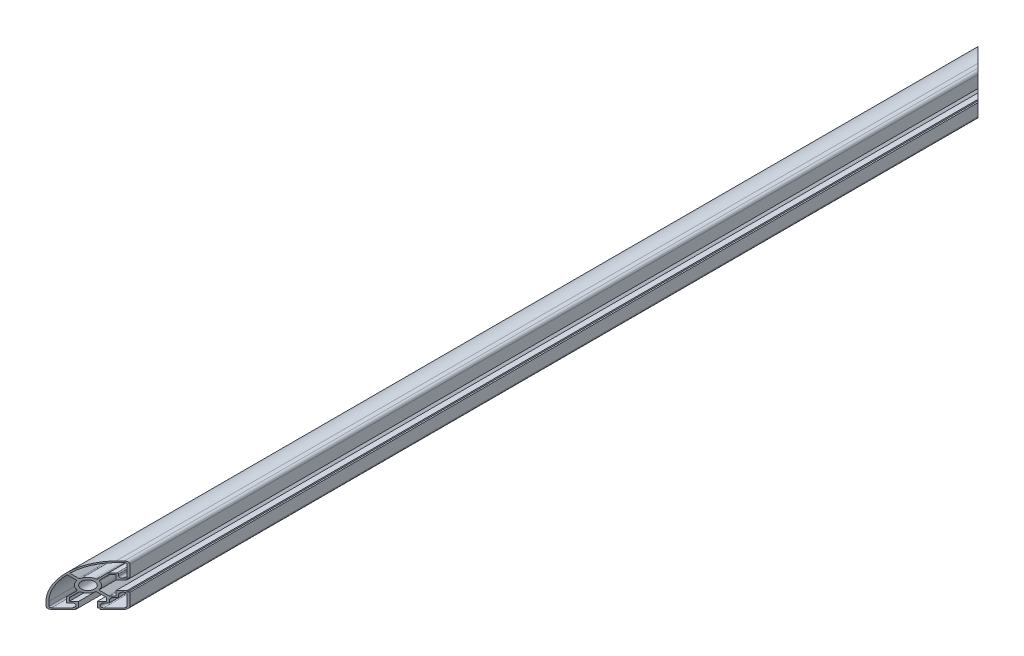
from build123d import *

# Parameters (mm, degrees)
LINEAR_START                    = 1560.85679
SKIZZE1_R                       = 5
LINEAR_AUSTRAGEN1_DEPTH         = 1000
SCHNITT_LINEAR_AUSTRAGEN2_DEPTH = 74.357312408


with BuildPart() as part:
    # Skizze1 → Linear austragen1 (new body)
    with BuildSketch(Plane.XY.offset(LINEAR_START)):
        with BuildLine():
            Line((-16, 0), (-3, 0))
            ThreePointArc((-3, 0), (-0.878679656, 0.878679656), (0, 3))
            Line((0, 3), (0, 16))
            Line((0, 16), (-1.5, 16))
            Line((-1.5, 16), (-1.5, 17.5))
            Line((-1.5, 17.5), (-7.5, 17.5))
            Line((-7.5, 17.5), (-7.5, 12.5))
            Line((-7.5, 12.5), (-10.671572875, 12.5))
            ThreePointArc((-10.671572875, 12.5), (-11.054256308, 12.576120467), (-11.378679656, 12.792893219))
            Line((-11.378679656, 12.792893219), (-16.667127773, 18.081341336))
            ThreePointArc((-16.667127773, 18.081341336), (-15.192648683, 22.113270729), (-16.233316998, 26.278310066))
            ThreePointArc((-16.233316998, 26.278310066), (-16.369567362, 26.915762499), (-16.084036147, 27.50175029))
            Line((-16.084036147, 27.50175029), (-11.378679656, 32.207106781))
            ThreePointArc((-11.378679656, 32.207106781), (-11.054256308, 32.423879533), (-10.671572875, 32.5))
            Line((-10.671572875, 32.5), (-7.5, 32.5))
            Line((-7.5, 32.5), (-7.5, 27.5))
            Line((-7.5, 27.5), (-1.5, 27.5))
            Line((-1.5, 27.5), (-1.5, 29))
            Line((-1.5, 29), (0, 29))
            Line((0, 29), (0, 42))
            ThreePointArc((0, 42), (-0.878679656, 44.121320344), (-3, 45))
            Line((-3, 45), (-7.5, 45))
            ThreePointArc((-7.5, 45), (-34.016504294, 34.016504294), (-45, 7.5))
            Line((-45, 7.5), (-45, 3))
            ThreePointArc((-45, 3), (-44.121320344, 0.878679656), (-42, 0))
            Line((-42, 0), (-29, 0))
            Line((-29, 0), (-29, 1.5))
            Line((-29, 1.5), (-27.5, 1.5))
            Line((-27.5, 1.5), (-27.5, 7.5))
            Line((-27.5, 7.5), (-32.5, 7.5))
            Line((-32.5, 7.5), (-32.5, 10.671572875))
            ThreePointArc((-32.5, 10.671572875), (-32.423879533, 11.054256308), (-32.207106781, 11.378679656))
            Line((-32.207106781, 11.378679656), (-27.50175029, 16.084036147))
            ThreePointArc((-27.50175029, 16.084036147), (-26.915762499, 16.369567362), (-26.278310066, 16.233316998))
            ThreePointArc((-26.278310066, 16.233316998), (-22.113270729, 15.192648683), (-18.081341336, 16.667127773))
            Line((-18.081341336, 16.667127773), (-12.792893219, 11.378679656))
            ThreePointArc((-12.792893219, 11.378679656), (-12.576120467, 11.054256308), (-12.5, 10.671572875))
            Line((-12.5, 10.671572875), (-12.5, 7.5))
            Line((-12.5, 7.5), (-17.5, 7.5))
            Line((-17.5, 7.5), (-17.5, 1.5))
            Line((-17.5, 1.5), (-16, 1.5))
            Line((-16, 1.5), (-16, 0))
        make_face()
        with BuildLine():
            Line((-14, 6), (-11, 6))
            Line((-11, 6), (-11, 9))
            ThreePointArc((-11, 9), (-10.414213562, 10.414213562), (-9, 11))
            Line((-9, 11), (-6, 11))
            Line((-6, 11), (-6, 14))
            ThreePointArc((-6, 14), (-5.414213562, 15.414213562), (-4, 16))
            Line((-4, 16), (-3.5, 16))
            ThreePointArc((-3.5, 16), (-2.085786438, 15.414213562), (-1.5, 14))
            Line((-1.5, 14), (-1.5, 3))
            ThreePointArc((-1.5, 3), (-1.939339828, 1.939339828), (-3, 1.5))
            Line((-3, 1.5), (-14, 1.5))
            ThreePointArc((-14, 1.5), (-15.414213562, 2.085786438), (-16, 3.5))
            Line((-16, 3.5), (-16, 4))
            ThreePointArc((-16, 4), (-15.414213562, 5.414213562), (-14, 6))
        make_face(mode=Mode.SUBTRACT)
        with BuildLine():
            Line((-27.50175029, 28.915963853), (-32.238914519, 33.653128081))
            ThreePointArc((-32.238914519, 33.653128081), (-20.813290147, 40.947814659), (-7.5, 43.5))
            Line((-7.5, 43.5), (-3, 43.5))
            ThreePointArc((-3, 43.5), (-1.939339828, 43.060660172), (-1.5, 42))
            Line((-1.5, 42), (-1.5, 31))
            ThreePointArc((-1.5, 31), (-2.085786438, 29.585786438), (-3.5, 29))
            Line((-3.5, 29), (-4, 29))
            ThreePointArc((-4, 29), (-5.414213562, 29.585786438), (-6, 31))
            Line((-6, 31), (-6, 33))
            ThreePointArc((-6, 33), (-6.292893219, 33.707106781), (-7, 34))
            Line((-7, 34), (-11.292893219, 34))
            ThreePointArc((-11.292893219, 34), (-11.675576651, 33.923879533), (-12, 33.707106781))
            Line((-12, 33.707106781), (-17.068568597, 28.638538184))
            ThreePointArc((-17.068568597, 28.638538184), (-17.685133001, 28.349752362), (-18.343668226, 28.522611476))
            ThreePointArc((-18.343668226, 28.522611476), (-22.275015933, 29.814118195), (-26.278310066, 28.766683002))
            ThreePointArc((-26.278310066, 28.766683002), (-26.915762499, 28.630432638), (-27.50175029, 28.915963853))
        make_face(mode=Mode.SUBTRACT)
        with BuildLine():
            Line((-33.653128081, 32.238914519), (-28.915963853, 27.50175029))
            ThreePointArc((-28.915963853, 27.50175029), (-28.630432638, 26.915762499), (-28.766683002, 26.278310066))
            ThreePointArc((-28.766683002, 26.278310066), (-29.814118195, 22.275015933), (-28.522611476, 18.343668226))
            ThreePointArc((-28.522611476, 18.343668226), (-28.349752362, 17.685133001), (-28.638538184, 17.068568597))
            Line((-28.638538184, 17.068568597), (-34, 11.707106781))
            Line((-34, 11.707106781), (-34, 6))
            Line((-34, 6), (-31, 6))
            ThreePointArc((-31, 6), (-29.585786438, 5.414213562), (-29, 4))
            Line((-29, 4), (-29, 3.5))
            ThreePointArc((-29, 3.5), (-29.585786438, 2.085786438), (-31, 1.5))
            Line((-31, 1.5), (-42, 1.5))
            ThreePointArc((-42, 1.5), (-43.060660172, 1.939339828), (-43.5, 3))
            Line((-43.5, 3), (-43.5, 7.5))
            ThreePointArc((-43.5, 7.5), (-40.947814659, 20.813290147), (-33.653128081, 32.238914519))
        make_face(mode=Mode.SUBTRACT)
        with Locations((-22.5, 22.5)):
            Circle(SKIZZE1_R, mode=Mode.SUBTRACT)
    extrude(amount=LINEAR_AUSTRAGEN1_DEPTH)

    # Skizze5 → Schnitt-Linear austragen2 (cut)
    with BuildSketch(Plane.XZ):
        Polygon((-45, 1560.856790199), (0, 1605.856790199), (0, 1560.856790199), align=None)
        Polygon((-45, 2560.856790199), (0, 2515.856790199), (0, 2560.856790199), align=None)
    extrude(amount=-SCHNITT_LINEAR_AUSTRAGEN2_DEPTH, mode=Mode.SUBTRACT)


solid = part.part
